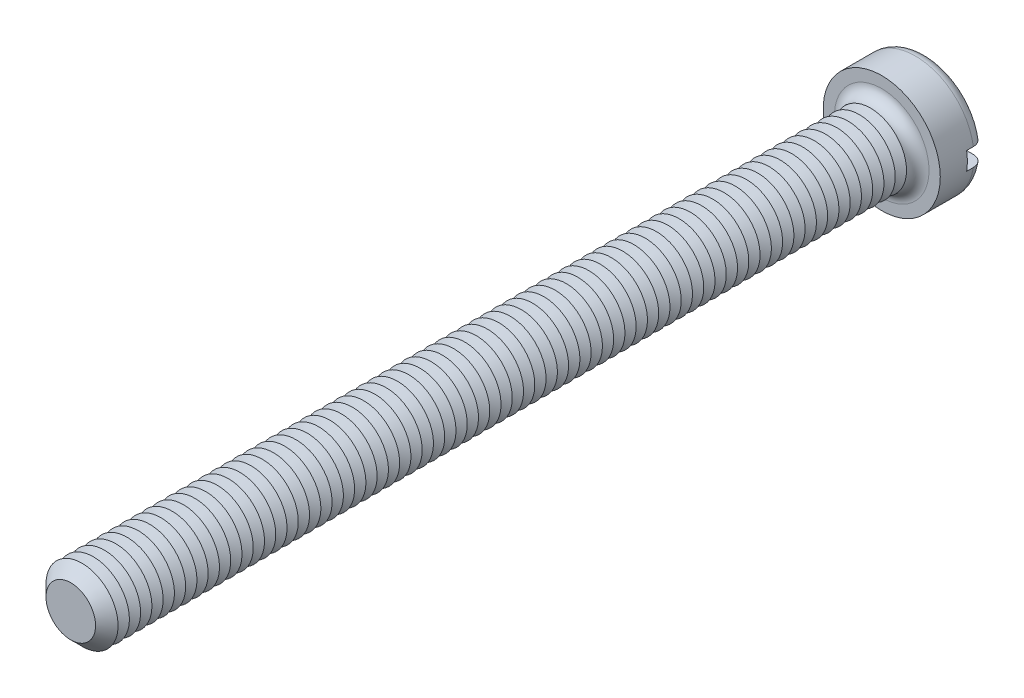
from build123d import *

# Parameters (mm, degrees)
SKETCH3_R           = 6.5
BOSS_EXTRUDE2_DEPTH = 5
SKETCH4_R           = 4
BOSS_EXTRUDE3_DEPTH = 90
FILLET1_R           = 1.25
CHAMFER1_SIZE       = 1.25
LPATTERN1_COUNT     = 70
LPATTERN1_PITCH     = 1.25
SKETCH8_W           = 13
SKETCH8_H           = 2
CUT_EXTRUDE1_DEPTH  = 2


with BuildPart() as part:
    # Sketch3 → Boss-Extrude2 (new body)
    with BuildSketch(Plane.XY):
        Circle(SKETCH3_R)
    extrude(amount=-BOSS_EXTRUDE2_DEPTH)

    # Sketch4 → Boss-Extrude3 (add)
    with BuildSketch(Plane.XY):
        with Locations(Location((0, 0, 0), (0, 0, 180))):
            Circle(SKETCH4_R)
    extrude(amount=BOSS_EXTRUDE3_DEPTH)

    # Fillet1
    fillet1_edges = [part.edges().sort_by_distance(p)[0] for p in [
        (-6.5, 0, -5),
        (4, 0, 0),
    ]]
    fillet(fillet1_edges, radius=FILLET1_R)

    # Chamfer1
    chamfer1_edges = [part.edges().sort_by_distance(p)[0] for p in [
        (4, 0, 90),
    ]]
    chamfer(chamfer1_edges, length=CHAMFER1_SIZE)

    # Sketch6 → Cut-Revolve1 (revolve, cut)
    with BuildSketch(Plane(origin=(0, 0, 0), x_dir=(0, 0, -1), z_dir=(1, 0, 0)), mode=Mode.PRIVATE) as cut_revolve1_sk:
        Polygon((-1.25, 4), (-1.875, 2.917468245), (-2.5, 4), align=None)
    cut_revolve1 = revolve(cut_revolve1_sk.sketch.rotate(Axis((0, 0, -1.694361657), (0, 0, 1)), 90), axis=Axis((0, 0, -1.694361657), (0, 0, 1)), mode=Mode.SUBTRACT)

    # LPattern1: Cut-Revolve1 ×70
    with Locations(*[(0, 0, i * LPATTERN1_PITCH) for i in range(1, LPATTERN1_COUNT)]):
        add(cut_revolve1, mode=Mode.SUBTRACT)

    # Sketch8 → Cut-Extrude1 (cut)
    with BuildSketch(Plane(origin=(0, 0, -5), x_dir=(-1, 0, 0), z_dir=(0, 0, -1))):
        Rectangle(SKETCH8_W, SKETCH8_H)
    extrude(amount=-CUT_EXTRUDE1_DEPTH, mode=Mode.SUBTRACT)


solid = part.part
